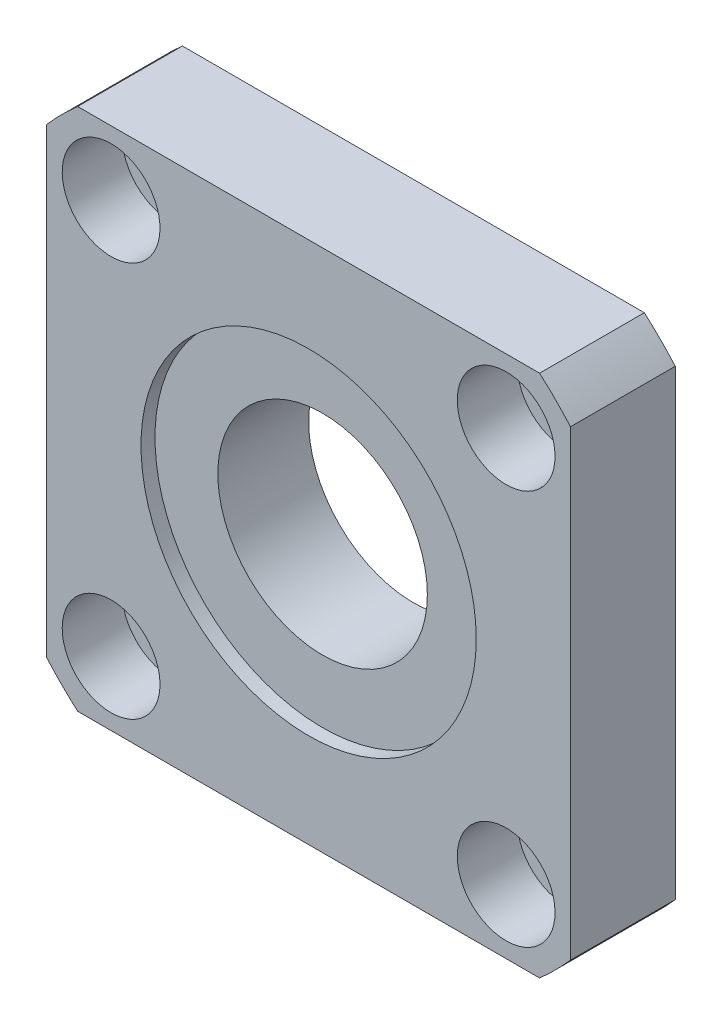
ISO-10303-21;
HEADER;
FILE_DESCRIPTION(('STEP AP214'),'2;1');
FILE_NAME('part.step','',(''),(''),'','','');
FILE_SCHEMA(('AUTOMOTIVE_DESIGN { 1 0 10303 214 1 1 1 1 }'));
ENDSEC;
DATA;
#1=APPLICATION_CONTEXT('core data for automotive mechanical design processes');
#2=APPLICATION_PROTOCOL_DEFINITION('international standard','automotive_design',2000,#1);
#3=PRODUCT_CONTEXT('',#1,'mechanical');
#4=PRODUCT('Part','Part','',(#3));
#5=PRODUCT_RELATED_PRODUCT_CATEGORY('part','',(#4));
#6=PRODUCT_DEFINITION_FORMATION('','',#4);
#7=PRODUCT_DEFINITION_CONTEXT('part definition',#1,'design');
#8=PRODUCT_DEFINITION('design','',#6,#7);
#9=PRODUCT_DEFINITION_SHAPE('','',#8);
#10=(LENGTH_UNIT() NAMED_UNIT(*) SI_UNIT(.MILLI.,.METRE.));
#11=(NAMED_UNIT(*) PLANE_ANGLE_UNIT() SI_UNIT($,.RADIAN.));
#12=(NAMED_UNIT(*) SI_UNIT($,.STERADIAN.) SOLID_ANGLE_UNIT());
#13=UNCERTAINTY_MEASURE_WITH_UNIT(LENGTH_MEASURE(1.E-05),#10,'distance_accuracy_value','');
#14=(GEOMETRIC_REPRESENTATION_CONTEXT(3) GLOBAL_UNCERTAINTY_ASSIGNED_CONTEXT((#13)) GLOBAL_UNIT_ASSIGNED_CONTEXT((#10,
#11,#12)) REPRESENTATION_CONTEXT('',''));
#15=CARTESIAN_POINT('',(0.,0.,0.));
#16=DIRECTION('',(0.,0.,1.));
#17=DIRECTION('',(1.,0.,0.));
#18=AXIS2_PLACEMENT_3D('',#15,#16,#17);
#19=CARTESIAN_POINT('',(0.,0.,15.));
#20=DIRECTION('',(0.,0.,-1.));
#21=DIRECTION('',(-1.,0.,0.));
#22=AXIS2_PLACEMENT_3D('',#19,#20,#21);
#23=CYLINDRICAL_SURFACE('',#22,15.);
#24=CARTESIAN_POINT('',(0.,0.,0.));
#25=DIRECTION('',(0.,0.,1.));
#26=DIRECTION('',(1.,0.,0.));
#27=AXIS2_PLACEMENT_3D('',#24,#25,#26);
#28=CIRCLE('',#27,15.);
#29=CARTESIAN_POINT('',(15.,0.,0.));
#30=VERTEX_POINT('',#29);
#31=EDGE_CURVE('E95',#30,#30,#28,.T.);
#32=ORIENTED_EDGE('',*,*,#31,.F.);
#33=EDGE_LOOP('',(#32));
#34=FACE_BOUND('',#33,.T.);
#35=CARTESIAN_POINT('',(0.,0.,13.));
#36=DIRECTION('',(0.,0.,1.));
#37=DIRECTION('',(1.,0.,0.));
#38=AXIS2_PLACEMENT_3D('',#35,#36,#37);
#39=CIRCLE('',#38,15.);
#40=CARTESIAN_POINT('',(15.,0.,13.));
#41=VERTEX_POINT('',#40);
#42=EDGE_CURVE('E18',#41,#41,#39,.T.);
#43=ORIENTED_EDGE('',*,*,#42,.T.);
#44=EDGE_LOOP('',(#43));
#45=FACE_BOUND('',#44,.T.);
#46=ADVANCED_FACE('F14',(#34,#45),#23,.F.);
#47=CARTESIAN_POINT('',(-28.2842712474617,28.2842712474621,0.));
#48=DIRECTION('',(0.,0.,1.));
#49=DIRECTION('',(1.,0.,0.));
#50=AXIS2_PLACEMENT_3D('',#47,#48,#49);
#51=CYLINDRICAL_SURFACE('',#50,5.);
#52=CARTESIAN_POINT('',(-28.2842712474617,28.2842712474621,0.));
#53=DIRECTION('',(0.,0.,1.));
#54=DIRECTION('',(0.,1.,0.));
#55=AXIS2_PLACEMENT_3D('',#52,#53,#54);
#56=CIRCLE('',#55,5.);
#57=CARTESIAN_POINT('',(-28.2842712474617,33.2842712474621,0.));
#58=VERTEX_POINT('',#57);
#59=EDGE_CURVE('E158',#58,#58,#56,.T.);
#60=ORIENTED_EDGE('',*,*,#59,.F.);
#61=EDGE_LOOP('',(#60));
#62=FACE_BOUND('',#61,.T.);
#63=CARTESIAN_POINT('',(-28.2842712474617,28.2842712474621,6.4));
#64=DIRECTION('',(0.,0.,1.));
#65=DIRECTION('',(1.,0.,0.));
#66=AXIS2_PLACEMENT_3D('',#63,#64,#65);
#67=CIRCLE('',#66,5.);
#68=CARTESIAN_POINT('',(-23.2842712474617,28.2842712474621,6.4));
#69=VERTEX_POINT('',#68);
#70=EDGE_CURVE('E164',#69,#69,#67,.F.);
#71=ORIENTED_EDGE('',*,*,#70,.F.);
#72=EDGE_LOOP('',(#71));
#73=FACE_BOUND('',#72,.T.);
#74=ADVANCED_FACE('F206',(#62,#73),#51,.F.);
#75=CARTESIAN_POINT('',(-28.2842712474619,-28.2842712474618,0.));
#76=DIRECTION('',(0.,0.,1.));
#77=DIRECTION('',(1.,0.,0.));
#78=AXIS2_PLACEMENT_3D('',#75,#76,#77);
#79=CYLINDRICAL_SURFACE('',#78,5.);
#80=CARTESIAN_POINT('',(-28.2842712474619,-28.2842712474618,0.));
#81=DIRECTION('',(0.,0.,1.));
#82=DIRECTION('',(-1.,0.,0.));
#83=AXIS2_PLACEMENT_3D('',#80,#81,#82);
#84=CIRCLE('',#83,5.);
#85=CARTESIAN_POINT('',(-33.284271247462,-28.2842712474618,0.));
#86=VERTEX_POINT('',#85);
#87=EDGE_CURVE('E189',#86,#86,#84,.T.);
#88=ORIENTED_EDGE('',*,*,#87,.F.);
#89=EDGE_LOOP('',(#88));
#90=FACE_BOUND('',#89,.T.);
#91=CARTESIAN_POINT('',(-28.2842712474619,-28.2842712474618,6.4));
#92=DIRECTION('',(0.,0.,1.));
#93=DIRECTION('',(1.,0.,0.));
#94=AXIS2_PLACEMENT_3D('',#91,#92,#93);
#95=CIRCLE('',#94,5.);
#96=CARTESIAN_POINT('',(-23.2842712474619,-28.2842712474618,6.4));
#97=VERTEX_POINT('',#96);
#98=EDGE_CURVE('E160',#97,#97,#95,.F.);
#99=ORIENTED_EDGE('',*,*,#98,.F.);
#100=EDGE_LOOP('',(#99));
#101=FACE_BOUND('',#100,.T.);
#102=ADVANCED_FACE('F288',(#90,#101),#79,.F.);
#103=CARTESIAN_POINT('',(28.2842712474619,-28.2842712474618,0.));
#104=DIRECTION('',(0.,0.,1.));
#105=DIRECTION('',(1.,0.,0.));
#106=AXIS2_PLACEMENT_3D('',#103,#104,#105);
#107=CYLINDRICAL_SURFACE('',#106,5.);
#108=CARTESIAN_POINT('',(28.2842712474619,-28.2842712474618,0.));
#109=DIRECTION('',(0.,0.,1.));
#110=DIRECTION('',(0.,-1.,0.));
#111=AXIS2_PLACEMENT_3D('',#108,#109,#110);
#112=CIRCLE('',#111,5.);
#113=CARTESIAN_POINT('',(28.2842712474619,-33.2842712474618,0.));
#114=VERTEX_POINT('',#113);
#115=EDGE_CURVE('E192',#114,#114,#112,.T.);
#116=ORIENTED_EDGE('',*,*,#115,.F.);
#117=EDGE_LOOP('',(#116));
#118=FACE_BOUND('',#117,.T.);
#119=CARTESIAN_POINT('',(28.2842712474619,-28.2842712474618,6.4));
#120=DIRECTION('',(0.,0.,1.));
#121=DIRECTION('',(1.,0.,0.));
#122=AXIS2_PLACEMENT_3D('',#119,#120,#121);
#123=CIRCLE('',#122,5.);
#124=CARTESIAN_POINT('',(33.284271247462,-28.2842712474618,6.4));
#125=VERTEX_POINT('',#124);
#126=EDGE_CURVE('E155',#125,#125,#123,.F.);
#127=ORIENTED_EDGE('',*,*,#126,.F.);
#128=EDGE_LOOP('',(#127));
#129=FACE_BOUND('',#128,.T.);
#130=ADVANCED_FACE('F276',(#118,#129),#107,.F.);
#131=CARTESIAN_POINT('',(28.2842712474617,28.2842712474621,0.));
#132=DIRECTION('',(0.,0.,1.));
#133=DIRECTION('',(1.,0.,0.));
#134=AXIS2_PLACEMENT_3D('',#131,#132,#133);
#135=CYLINDRICAL_SURFACE('',#134,5.);
#136=CARTESIAN_POINT('',(28.2842712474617,28.2842712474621,0.));
#137=DIRECTION('',(0.,0.,1.));
#138=DIRECTION('',(1.,0.,0.));
#139=AXIS2_PLACEMENT_3D('',#136,#137,#138);
#140=CIRCLE('',#139,5.);
#141=CARTESIAN_POINT('',(33.2842712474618,28.2842712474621,0.));
#142=VERTEX_POINT('',#141);
#143=EDGE_CURVE('E153',#142,#142,#140,.T.);
#144=ORIENTED_EDGE('',*,*,#143,.F.);
#145=EDGE_LOOP('',(#144));
#146=FACE_BOUND('',#145,.T.);
#147=CARTESIAN_POINT('',(28.2842712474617,28.2842712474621,6.4));
#148=DIRECTION('',(0.,0.,1.));
#149=DIRECTION('',(1.,0.,0.));
#150=AXIS2_PLACEMENT_3D('',#147,#148,#149);
#151=CIRCLE('',#150,5.);
#152=CARTESIAN_POINT('',(33.2842712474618,28.2842712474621,6.4));
#153=VERTEX_POINT('',#152);
#154=EDGE_CURVE('E150',#153,#153,#151,.F.);
#155=ORIENTED_EDGE('',*,*,#154,.F.);
#156=EDGE_LOOP('',(#155));
#157=FACE_BOUND('',#156,.T.);
#158=ADVANCED_FACE('F225',(#146,#157),#135,.F.);
#159=CARTESIAN_POINT('',(0.,0.,15.));
#160=DIRECTION('',(0.,0.,1.));
#161=DIRECTION('',(1.,0.,0.));
#162=AXIS2_PLACEMENT_3D('',#159,#160,#161);
#163=PLANE('',#162);
#164=CARTESIAN_POINT('',(0.,0.,15.));
#165=DIRECTION('',(0.,0.,1.));
#166=DIRECTION('',(1.,0.,0.));
#167=AXIS2_PLACEMENT_3D('',#164,#165,#166);
#168=CIRCLE('',#167,24.);
#169=CARTESIAN_POINT('',(24.,0.,15.));
#170=VERTEX_POINT('',#169);
#171=EDGE_CURVE('E213',#170,#170,#168,.T.);
#172=ORIENTED_EDGE('',*,*,#171,.F.);
#173=EDGE_LOOP('',(#172));
#174=FACE_BOUND('',#173,.T.);
#175=CARTESIAN_POINT('',(-28.2842712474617,28.2842712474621,15.));
#176=DIRECTION('',(0.,0.,1.));
#177=DIRECTION('',(0.,1.,0.));
#178=AXIS2_PLACEMENT_3D('',#175,#176,#177);
#179=CIRCLE('',#178,7.);
#180=CARTESIAN_POINT('',(-28.2842712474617,35.2842712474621,15.));
#181=VERTEX_POINT('',#180);
#182=EDGE_CURVE('E173',#181,#181,#179,.T.);
#183=ORIENTED_EDGE('',*,*,#182,.F.);
#184=EDGE_LOOP('',(#183));
#185=FACE_BOUND('',#184,.T.);
#186=CARTESIAN_POINT('',(-28.2842712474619,-28.2842712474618,15.));
#187=DIRECTION('',(0.,0.,1.));
#188=DIRECTION('',(-1.,0.,0.));
#189=AXIS2_PLACEMENT_3D('',#186,#187,#188);
#190=CIRCLE('',#189,7.);
#191=CARTESIAN_POINT('',(-35.284271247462,-28.2842712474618,15.));
#192=VERTEX_POINT('',#191);
#193=EDGE_CURVE('E166',#192,#192,#190,.T.);
#194=ORIENTED_EDGE('',*,*,#193,.F.);
#195=EDGE_LOOP('',(#194));
#196=FACE_BOUND('',#195,.T.);
#197=CARTESIAN_POINT('',(28.2842712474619,-28.2842712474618,15.));
#198=DIRECTION('',(0.,0.,1.));
#199=DIRECTION('',(0.,-1.,0.));
#200=AXIS2_PLACEMENT_3D('',#197,#198,#199);
#201=CIRCLE('',#200,7.);
#202=CARTESIAN_POINT('',(28.2842712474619,-35.2842712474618,15.));
#203=VERTEX_POINT('',#202);
#204=EDGE_CURVE('E162',#203,#203,#201,.T.);
#205=ORIENTED_EDGE('',*,*,#204,.F.);
#206=EDGE_LOOP('',(#205));
#207=FACE_BOUND('',#206,.T.);
#208=CARTESIAN_POINT('',(28.2842712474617,28.2842712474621,15.));
#209=DIRECTION('',(0.,0.,1.));
#210=DIRECTION('',(1.,0.,0.));
#211=AXIS2_PLACEMENT_3D('',#208,#209,#210);
#212=CIRCLE('',#211,7.);
#213=CARTESIAN_POINT('',(35.2842712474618,28.2842712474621,15.));
#214=VERTEX_POINT('',#213);
#215=EDGE_CURVE('E195',#214,#214,#212,.T.);
#216=ORIENTED_EDGE('',*,*,#215,.F.);
#217=EDGE_LOOP('',(#216));
#218=FACE_BOUND('',#217,.T.);
#219=CARTESIAN_POINT('',(0.,0.,15.));
#220=DIRECTION('',(0.,0.,1.));
#221=DIRECTION('',(1.,0.,0.));
#222=AXIS2_PLACEMENT_3D('',#219,#220,#221);
#223=CIRCLE('',#222,50.);
#224=CARTESIAN_POINT('',(37.5,33.0718913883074,15.));
#225=VERTEX_POINT('',#224);
#226=CARTESIAN_POINT('',(33.0718913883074,37.5,15.));
#227=VERTEX_POINT('',#226);
#228=EDGE_CURVE('E120',#225,#227,#223,.T.);
#229=ORIENTED_EDGE('',*,*,#228,.T.);
#230=DIRECTION('',(-1.,0.,0.));
#231=VECTOR('',#230,1.);
#232=CARTESIAN_POINT('',(33.0718913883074,37.5,15.));
#233=LINE('',#232,#231);
#234=CARTESIAN_POINT('',(-33.0718913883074,37.5,15.));
#235=VERTEX_POINT('',#234);
#236=EDGE_CURVE('E87',#227,#235,#233,.T.);
#237=ORIENTED_EDGE('',*,*,#236,.T.);
#238=CARTESIAN_POINT('',(0.,0.,15.));
#239=DIRECTION('',(0.,0.,-1.));
#240=DIRECTION('',(-1.,0.,0.));
#241=AXIS2_PLACEMENT_3D('',#238,#239,#240);
#242=CIRCLE('',#241,50.);
#243=CARTESIAN_POINT('',(-37.5,33.0718913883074,15.));
#244=VERTEX_POINT('',#243);
#245=EDGE_CURVE('E123',#244,#235,#242,.T.);
#246=ORIENTED_EDGE('',*,*,#245,.F.);
#247=DIRECTION('',(0.,-1.,0.));
#248=VECTOR('',#247,1.);
#249=CARTESIAN_POINT('',(-37.5,33.0718913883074,15.));
#250=LINE('',#249,#248);
#251=CARTESIAN_POINT('',(-37.5,-33.0718913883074,15.));
#252=VERTEX_POINT('',#251);
#253=EDGE_CURVE('E126',#244,#252,#250,.T.);
#254=ORIENTED_EDGE('',*,*,#253,.T.);
#255=CARTESIAN_POINT('',(0.,0.,15.));
#256=DIRECTION('',(0.,0.,1.));
#257=DIRECTION('',(1.,0.,0.));
#258=AXIS2_PLACEMENT_3D('',#255,#256,#257);
#259=CIRCLE('',#258,50.);
#260=CARTESIAN_POINT('',(-33.0718913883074,-37.5,15.));
#261=VERTEX_POINT('',#260);
#262=EDGE_CURVE('E129',#252,#261,#259,.T.);
#263=ORIENTED_EDGE('',*,*,#262,.T.);
#264=DIRECTION('',(-1.,0.,0.));
#265=VECTOR('',#264,1.);
#266=CARTESIAN_POINT('',(33.0718913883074,-37.5,15.));
#267=LINE('',#266,#265);
#268=CARTESIAN_POINT('',(33.0718913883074,-37.5,15.));
#269=VERTEX_POINT('',#268);
#270=EDGE_CURVE('E132',#269,#261,#267,.T.);
#271=ORIENTED_EDGE('',*,*,#270,.F.);
#272=CARTESIAN_POINT('',(0.,0.,15.));
#273=DIRECTION('',(0.,0.,-1.));
#274=DIRECTION('',(-1.,0.,0.));
#275=AXIS2_PLACEMENT_3D('',#272,#273,#274);
#276=CIRCLE('',#275,50.);
#277=CARTESIAN_POINT('',(37.5,-33.0718913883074,15.));
#278=VERTEX_POINT('',#277);
#279=EDGE_CURVE('E135',#278,#269,#276,.T.);
#280=ORIENTED_EDGE('',*,*,#279,.F.);
#281=DIRECTION('',(0.,-1.,0.));
#282=VECTOR('',#281,1.);
#283=CARTESIAN_POINT('',(37.5,33.0718913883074,15.));
#284=LINE('',#283,#282);
#285=EDGE_CURVE('E137',#225,#278,#284,.T.);
#286=ORIENTED_EDGE('',*,*,#285,.F.);
#287=EDGE_LOOP('',(#229,#237,#246,#254,#263,#271,#280,#286));
#288=FACE_BOUND('',#287,.T.);
#289=ADVANCED_FACE('F222',(#174,#185,#196,#207,#218,#288),#163,.T.);
#290=CARTESIAN_POINT('',(0.,0.,0.));
#291=DIRECTION('',(0.,0.,1.));
#292=DIRECTION('',(1.,0.,0.));
#293=AXIS2_PLACEMENT_3D('',#290,#291,#292);
#294=PLANE('',#293);
#295=ORIENTED_EDGE('',*,*,#59,.T.);
#296=EDGE_LOOP('',(#295));
#297=FACE_BOUND('',#296,.T.);
#298=ORIENTED_EDGE('',*,*,#87,.T.);
#299=EDGE_LOOP('',(#298));
#300=FACE_BOUND('',#299,.T.);
#301=ORIENTED_EDGE('',*,*,#115,.T.);
#302=EDGE_LOOP('',(#301));
#303=FACE_BOUND('',#302,.T.);
#304=ORIENTED_EDGE('',*,*,#143,.T.);
#305=EDGE_LOOP('',(#304));
#306=FACE_BOUND('',#305,.T.);
#307=CARTESIAN_POINT('',(0.,0.,0.));
#308=DIRECTION('',(0.,0.,1.));
#309=DIRECTION('',(1.,0.,0.));
#310=AXIS2_PLACEMENT_3D('',#307,#308,#309);
#311=CIRCLE('',#310,50.);
#312=CARTESIAN_POINT('',(37.5,33.0718913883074,0.));
#313=VERTEX_POINT('',#312);
#314=CARTESIAN_POINT('',(33.0718913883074,37.5,0.));
#315=VERTEX_POINT('',#314);
#316=EDGE_CURVE('E91',#313,#315,#311,.T.);
#317=ORIENTED_EDGE('',*,*,#316,.F.);
#318=DIRECTION('',(0.,-1.,0.));
#319=VECTOR('',#318,1.);
#320=CARTESIAN_POINT('',(37.5,33.0718913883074,0.));
#321=LINE('',#320,#319);
#322=CARTESIAN_POINT('',(37.5,-33.0718913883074,0.));
#323=VERTEX_POINT('',#322);
#324=EDGE_CURVE('E118',#313,#323,#321,.T.);
#325=ORIENTED_EDGE('',*,*,#324,.T.);
#326=CARTESIAN_POINT('',(0.,0.,0.));
#327=DIRECTION('',(0.,0.,-1.));
#328=DIRECTION('',(-1.,0.,0.));
#329=AXIS2_PLACEMENT_3D('',#326,#327,#328);
#330=CIRCLE('',#329,50.);
#331=CARTESIAN_POINT('',(33.0718913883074,-37.5,0.));
#332=VERTEX_POINT('',#331);
#333=EDGE_CURVE('E115',#323,#332,#330,.T.);
#334=ORIENTED_EDGE('',*,*,#333,.T.);
#335=DIRECTION('',(-1.,0.,0.));
#336=VECTOR('',#335,1.);
#337=CARTESIAN_POINT('',(33.0718913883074,-37.5,0.));
#338=LINE('',#337,#336);
#339=CARTESIAN_POINT('',(-33.0718913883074,-37.5,0.));
#340=VERTEX_POINT('',#339);
#341=EDGE_CURVE('E112',#332,#340,#338,.T.);
#342=ORIENTED_EDGE('',*,*,#341,.T.);
#343=CARTESIAN_POINT('',(0.,0.,0.));
#344=DIRECTION('',(0.,0.,1.));
#345=DIRECTION('',(1.,0.,0.));
#346=AXIS2_PLACEMENT_3D('',#343,#344,#345);
#347=CIRCLE('',#346,50.);
#348=CARTESIAN_POINT('',(-37.5,-33.0718913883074,0.));
#349=VERTEX_POINT('',#348);
#350=EDGE_CURVE('E109',#349,#340,#347,.T.);
#351=ORIENTED_EDGE('',*,*,#350,.F.);
#352=DIRECTION('',(0.,-1.,0.));
#353=VECTOR('',#352,1.);
#354=CARTESIAN_POINT('',(-37.5,33.0718913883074,0.));
#355=LINE('',#354,#353);
#356=CARTESIAN_POINT('',(-37.5,33.0718913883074,0.));
#357=VERTEX_POINT('',#356);
#358=EDGE_CURVE('E103',#357,#349,#355,.T.);
#359=ORIENTED_EDGE('',*,*,#358,.F.);
#360=CARTESIAN_POINT('',(0.,0.,0.));
#361=DIRECTION('',(0.,0.,-1.));
#362=DIRECTION('',(-1.,0.,0.));
#363=AXIS2_PLACEMENT_3D('',#360,#361,#362);
#364=CIRCLE('',#363,50.);
#365=CARTESIAN_POINT('',(-33.0718913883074,37.5,0.));
#366=VERTEX_POINT('',#365);
#367=EDGE_CURVE('E101',#357,#366,#364,.T.);
#368=ORIENTED_EDGE('',*,*,#367,.T.);
#369=DIRECTION('',(-1.,0.,0.));
#370=VECTOR('',#369,1.);
#371=CARTESIAN_POINT('',(33.0718913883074,37.5,0.));
#372=LINE('',#371,#370);
#373=EDGE_CURVE('E84',#315,#366,#372,.T.);
#374=ORIENTED_EDGE('',*,*,#373,.F.);
#375=EDGE_LOOP('',(#317,#325,#334,#342,#351,#359,#368,#374));
#376=FACE_BOUND('',#375,.T.);
#377=ORIENTED_EDGE('',*,*,#31,.T.);
#378=EDGE_LOOP('',(#377));
#379=FACE_BOUND('',#378,.T.);
#380=ADVANCED_FACE('F97',(#297,#300,#303,#306,#376,#379),#294,.F.);
#381=CARTESIAN_POINT('',(0.,0.,15.));
#382=DIRECTION('',(0.,0.,-1.));
#383=DIRECTION('',(-1.,0.,0.));
#384=AXIS2_PLACEMENT_3D('',#381,#382,#383);
#385=CYLINDRICAL_SURFACE('',#384,50.);
#386=DIRECTION('',(0.,0.,-1.));
#387=VECTOR('',#386,1.);
#388=CARTESIAN_POINT('',(33.0718913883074,37.5,15.));
#389=LINE('',#388,#387);
#390=EDGE_CURVE('E9',#227,#315,#389,.T.);
#391=ORIENTED_EDGE('',*,*,#390,.F.);
#392=ORIENTED_EDGE('',*,*,#228,.F.);
#393=DIRECTION('',(0.,0.,-1.));
#394=VECTOR('',#393,1.);
#395=CARTESIAN_POINT('',(37.5,33.0718913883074,15.));
#396=LINE('',#395,#394);
#397=EDGE_CURVE('E31',#225,#313,#396,.T.);
#398=ORIENTED_EDGE('',*,*,#397,.T.);
#399=ORIENTED_EDGE('',*,*,#316,.T.);
#400=EDGE_LOOP('',(#391,#392,#398,#399));
#401=FACE_BOUND('',#400,.T.);
#402=ADVANCED_FACE('F92',(#401),#385,.T.);
#403=CARTESIAN_POINT('',(33.0718913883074,37.5,15.));
#404=DIRECTION('',(0.,-1.,0.));
#405=DIRECTION('',(0.,0.,-1.));
#406=AXIS2_PLACEMENT_3D('',#403,#404,#405);
#407=PLANE('',#406);
#408=DIRECTION('',(0.,0.,-1.));
#409=VECTOR('',#408,1.);
#410=CARTESIAN_POINT('',(-33.0718913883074,37.5,15.));
#411=LINE('',#410,#409);
#412=EDGE_CURVE('E23',#235,#366,#411,.T.);
#413=ORIENTED_EDGE('',*,*,#412,.F.);
#414=ORIENTED_EDGE('',*,*,#236,.F.);
#415=ORIENTED_EDGE('',*,*,#390,.T.);
#416=ORIENTED_EDGE('',*,*,#373,.T.);
#417=EDGE_LOOP('',(#413,#414,#415,#416));
#418=FACE_BOUND('',#417,.T.);
#419=ADVANCED_FACE('F16',(#418),#407,.F.);
#420=CARTESIAN_POINT('',(0.,0.,15.));
#421=DIRECTION('',(0.,0.,-1.));
#422=DIRECTION('',(-1.,0.,0.));
#423=AXIS2_PLACEMENT_3D('',#420,#421,#422);
#424=CYLINDRICAL_SURFACE('',#423,50.);
#425=DIRECTION('',(0.,0.,-1.));
#426=VECTOR('',#425,1.);
#427=CARTESIAN_POINT('',(-37.5,33.0718913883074,15.));
#428=LINE('',#427,#426);
#429=EDGE_CURVE('E147',#244,#357,#428,.T.);
#430=ORIENTED_EDGE('',*,*,#429,.F.);
#431=ORIENTED_EDGE('',*,*,#245,.T.);
#432=ORIENTED_EDGE('',*,*,#412,.T.);
#433=ORIENTED_EDGE('',*,*,#367,.F.);
#434=EDGE_LOOP('',(#430,#431,#432,#433));
#435=FACE_BOUND('',#434,.T.);
#436=ADVANCED_FACE('F251',(#435),#424,.T.);
#437=CARTESIAN_POINT('',(-37.5,33.0718913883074,15.));
#438=DIRECTION('',(1.,0.,0.));
#439=DIRECTION('',(0.,0.,-1.));
#440=AXIS2_PLACEMENT_3D('',#437,#438,#439);
#441=PLANE('',#440);
#442=DIRECTION('',(0.,0.,-1.));
#443=VECTOR('',#442,1.);
#444=CARTESIAN_POINT('',(-37.5,-33.0718913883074,15.));
#445=LINE('',#444,#443);
#446=EDGE_CURVE('E145',#252,#349,#445,.T.);
#447=ORIENTED_EDGE('',*,*,#446,.F.);
#448=ORIENTED_EDGE('',*,*,#253,.F.);
#449=ORIENTED_EDGE('',*,*,#429,.T.);
#450=ORIENTED_EDGE('',*,*,#358,.T.);
#451=EDGE_LOOP('',(#447,#448,#449,#450));
#452=FACE_BOUND('',#451,.T.);
#453=ADVANCED_FACE('F249',(#452),#441,.F.);
#454=CARTESIAN_POINT('',(0.,0.,15.));
#455=DIRECTION('',(0.,0.,-1.));
#456=DIRECTION('',(-1.,0.,0.));
#457=AXIS2_PLACEMENT_3D('',#454,#455,#456);
#458=CYLINDRICAL_SURFACE('',#457,50.);
#459=DIRECTION('',(0.,0.,-1.));
#460=VECTOR('',#459,1.);
#461=CARTESIAN_POINT('',(-33.0718913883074,-37.5,15.));
#462=LINE('',#461,#460);
#463=EDGE_CURVE('E143',#261,#340,#462,.T.);
#464=ORIENTED_EDGE('',*,*,#463,.F.);
#465=ORIENTED_EDGE('',*,*,#262,.F.);
#466=ORIENTED_EDGE('',*,*,#446,.T.);
#467=ORIENTED_EDGE('',*,*,#350,.T.);
#468=EDGE_LOOP('',(#464,#465,#466,#467));
#469=FACE_BOUND('',#468,.T.);
#470=ADVANCED_FACE('F246',(#469),#458,.T.);
#471=CARTESIAN_POINT('',(33.0718913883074,-37.5,15.));
#472=DIRECTION('',(0.,-1.,0.));
#473=DIRECTION('',(0.,0.,-1.));
#474=AXIS2_PLACEMENT_3D('',#471,#472,#473);
#475=PLANE('',#474);
#476=DIRECTION('',(0.,0.,-1.));
#477=VECTOR('',#476,1.);
#478=CARTESIAN_POINT('',(33.0718913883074,-37.5,15.));
#479=LINE('',#478,#477);
#480=EDGE_CURVE('E141',#269,#332,#479,.T.);
#481=ORIENTED_EDGE('',*,*,#480,.F.);
#482=ORIENTED_EDGE('',*,*,#270,.T.);
#483=ORIENTED_EDGE('',*,*,#463,.T.);
#484=ORIENTED_EDGE('',*,*,#341,.F.);
#485=EDGE_LOOP('',(#481,#482,#483,#484));
#486=FACE_BOUND('',#485,.T.);
#487=ADVANCED_FACE('F243',(#486),#475,.T.);
#488=CARTESIAN_POINT('',(0.,0.,15.));
#489=DIRECTION('',(0.,0.,-1.));
#490=DIRECTION('',(-1.,0.,0.));
#491=AXIS2_PLACEMENT_3D('',#488,#489,#490);
#492=CYLINDRICAL_SURFACE('',#491,50.);
#493=DIRECTION('',(0.,0.,-1.));
#494=VECTOR('',#493,1.);
#495=CARTESIAN_POINT('',(37.5,-33.0718913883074,15.));
#496=LINE('',#495,#494);
#497=EDGE_CURVE('E39',#278,#323,#496,.T.);
#498=ORIENTED_EDGE('',*,*,#497,.F.);
#499=ORIENTED_EDGE('',*,*,#279,.T.);
#500=ORIENTED_EDGE('',*,*,#480,.T.);
#501=ORIENTED_EDGE('',*,*,#333,.F.);
#502=EDGE_LOOP('',(#498,#499,#500,#501));
#503=FACE_BOUND('',#502,.T.);
#504=ADVANCED_FACE('F239',(#503),#492,.T.);
#505=CARTESIAN_POINT('',(37.5,33.0718913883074,15.));
#506=DIRECTION('',(1.,0.,0.));
#507=DIRECTION('',(0.,0.,-1.));
#508=AXIS2_PLACEMENT_3D('',#505,#506,#507);
#509=PLANE('',#508);
#510=ORIENTED_EDGE('',*,*,#285,.T.);
#511=ORIENTED_EDGE('',*,*,#497,.T.);
#512=ORIENTED_EDGE('',*,*,#324,.F.);
#513=ORIENTED_EDGE('',*,*,#397,.F.);
#514=EDGE_LOOP('',(#510,#511,#512,#513));
#515=FACE_BOUND('',#514,.T.);
#516=ADVANCED_FACE('F238',(#515),#509,.T.);
#517=CARTESIAN_POINT('',(28.2842712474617,28.2842712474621,6.4));
#518=DIRECTION('',(0.,0.,1.));
#519=DIRECTION('',(1.,0.,0.));
#520=AXIS2_PLACEMENT_3D('',#517,#518,#519);
#521=PLANE('',#520);
#522=CARTESIAN_POINT('',(28.2842712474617,28.2842712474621,6.4));
#523=DIRECTION('',(0.,0.,1.));
#524=DIRECTION('',(1.,0.,0.));
#525=AXIS2_PLACEMENT_3D('',#522,#523,#524);
#526=CIRCLE('',#525,7.);
#527=CARTESIAN_POINT('',(35.2842712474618,28.2842712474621,6.4));
#528=VERTEX_POINT('',#527);
#529=EDGE_CURVE('E154',#528,#528,#526,.T.);
#530=ORIENTED_EDGE('',*,*,#529,.T.);
#531=EDGE_LOOP('',(#530));
#532=FACE_BOUND('',#531,.T.);
#533=ORIENTED_EDGE('',*,*,#154,.T.);
#534=EDGE_LOOP('',(#533));
#535=FACE_BOUND('',#534,.T.);
#536=ADVANCED_FACE('F268',(#532,#535),#521,.T.);
#537=CARTESIAN_POINT('',(28.2842712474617,28.2842712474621,6.4));
#538=DIRECTION('',(0.,0.,1.));
#539=DIRECTION('',(1.,0.,0.));
#540=AXIS2_PLACEMENT_3D('',#537,#538,#539);
#541=CYLINDRICAL_SURFACE('',#540,7.);
#542=ORIENTED_EDGE('',*,*,#529,.F.);
#543=EDGE_LOOP('',(#542));
#544=FACE_BOUND('',#543,.T.);
#545=ORIENTED_EDGE('',*,*,#215,.T.);
#546=EDGE_LOOP('',(#545));
#547=FACE_BOUND('',#546,.T.);
#548=ADVANCED_FACE('F278',(#544,#547),#541,.F.);
#549=CARTESIAN_POINT('',(28.2842712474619,-28.2842712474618,6.4));
#550=DIRECTION('',(0.,0.,1.));
#551=DIRECTION('',(0.,-1.,0.));
#552=AXIS2_PLACEMENT_3D('',#549,#550,#551);
#553=PLANE('',#552);
#554=CARTESIAN_POINT('',(28.2842712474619,-28.2842712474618,6.4));
#555=DIRECTION('',(0.,0.,1.));
#556=DIRECTION('',(0.,-1.,0.));
#557=AXIS2_PLACEMENT_3D('',#554,#555,#556);
#558=CIRCLE('',#557,7.);
#559=CARTESIAN_POINT('',(28.2842712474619,-35.2842712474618,6.4));
#560=VERTEX_POINT('',#559);
#561=EDGE_CURVE('E159',#560,#560,#558,.T.);
#562=ORIENTED_EDGE('',*,*,#561,.T.);
#563=EDGE_LOOP('',(#562));
#564=FACE_BOUND('',#563,.T.);
#565=ORIENTED_EDGE('',*,*,#126,.T.);
#566=EDGE_LOOP('',(#565));
#567=FACE_BOUND('',#566,.T.);
#568=ADVANCED_FACE('F281',(#564,#567),#553,.T.);
#569=CARTESIAN_POINT('',(28.2842712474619,-28.2842712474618,6.4));
#570=DIRECTION('',(0.,0.,1.));
#571=DIRECTION('',(1.,0.,0.));
#572=AXIS2_PLACEMENT_3D('',#569,#570,#571);
#573=CYLINDRICAL_SURFACE('',#572,7.);
#574=ORIENTED_EDGE('',*,*,#561,.F.);
#575=EDGE_LOOP('',(#574));
#576=FACE_BOUND('',#575,.T.);
#577=ORIENTED_EDGE('',*,*,#204,.T.);
#578=EDGE_LOOP('',(#577));
#579=FACE_BOUND('',#578,.T.);
#580=ADVANCED_FACE('F296',(#576,#579),#573,.F.);
#581=CARTESIAN_POINT('',(-28.2842712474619,-28.2842712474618,6.4));
#582=DIRECTION('',(0.,0.,1.));
#583=DIRECTION('',(-1.,0.,0.));
#584=AXIS2_PLACEMENT_3D('',#581,#582,#583);
#585=PLANE('',#584);
#586=CARTESIAN_POINT('',(-28.2842712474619,-28.2842712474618,6.4));
#587=DIRECTION('',(0.,0.,1.));
#588=DIRECTION('',(-1.,0.,0.));
#589=AXIS2_PLACEMENT_3D('',#586,#587,#588);
#590=CIRCLE('',#589,7.);
#591=CARTESIAN_POINT('',(-35.284271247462,-28.2842712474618,6.4));
#592=VERTEX_POINT('',#591);
#593=EDGE_CURVE('E163',#592,#592,#590,.T.);
#594=ORIENTED_EDGE('',*,*,#593,.T.);
#595=EDGE_LOOP('',(#594));
#596=FACE_BOUND('',#595,.T.);
#597=ORIENTED_EDGE('',*,*,#98,.T.);
#598=EDGE_LOOP('',(#597));
#599=FACE_BOUND('',#598,.T.);
#600=ADVANCED_FACE('F299',(#596,#599),#585,.T.);
#601=CARTESIAN_POINT('',(-28.2842712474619,-28.2842712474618,6.4));
#602=DIRECTION('',(0.,0.,1.));
#603=DIRECTION('',(1.,0.,0.));
#604=AXIS2_PLACEMENT_3D('',#601,#602,#603);
#605=CYLINDRICAL_SURFACE('',#604,7.);
#606=ORIENTED_EDGE('',*,*,#593,.F.);
#607=EDGE_LOOP('',(#606));
#608=FACE_BOUND('',#607,.T.);
#609=ORIENTED_EDGE('',*,*,#193,.T.);
#610=EDGE_LOOP('',(#609));
#611=FACE_BOUND('',#610,.T.);
#612=ADVANCED_FACE('F304',(#608,#611),#605,.F.);
#613=CARTESIAN_POINT('',(-28.2842712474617,28.2842712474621,6.4));
#614=DIRECTION('',(0.,0.,1.));
#615=DIRECTION('',(0.,1.,0.));
#616=AXIS2_PLACEMENT_3D('',#613,#614,#615);
#617=PLANE('',#616);
#618=CARTESIAN_POINT('',(-28.2842712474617,28.2842712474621,6.4));
#619=DIRECTION('',(0.,0.,1.));
#620=DIRECTION('',(0.,1.,0.));
#621=AXIS2_PLACEMENT_3D('',#618,#619,#620);
#622=CIRCLE('',#621,7.);
#623=CARTESIAN_POINT('',(-28.2842712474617,35.2842712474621,6.4));
#624=VERTEX_POINT('',#623);
#625=EDGE_CURVE('E167',#624,#624,#622,.T.);
#626=ORIENTED_EDGE('',*,*,#625,.T.);
#627=EDGE_LOOP('',(#626));
#628=FACE_BOUND('',#627,.T.);
#629=ORIENTED_EDGE('',*,*,#70,.T.);
#630=EDGE_LOOP('',(#629));
#631=FACE_BOUND('',#630,.T.);
#632=ADVANCED_FACE('F307',(#628,#631),#617,.T.);
#633=CARTESIAN_POINT('',(-28.2842712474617,28.2842712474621,6.4));
#634=DIRECTION('',(0.,0.,1.));
#635=DIRECTION('',(1.,0.,0.));
#636=AXIS2_PLACEMENT_3D('',#633,#634,#635);
#637=CYLINDRICAL_SURFACE('',#636,7.);
#638=ORIENTED_EDGE('',*,*,#625,.F.);
#639=EDGE_LOOP('',(#638));
#640=FACE_BOUND('',#639,.T.);
#641=ORIENTED_EDGE('',*,*,#182,.T.);
#642=EDGE_LOOP('',(#641));
#643=FACE_BOUND('',#642,.T.);
#644=ADVANCED_FACE('F312',(#640,#643),#637,.F.);
#645=CARTESIAN_POINT('',(0.,0.,13.));
#646=DIRECTION('',(0.,0.,1.));
#647=DIRECTION('',(1.,0.,0.));
#648=AXIS2_PLACEMENT_3D('',#645,#646,#647);
#649=CYLINDRICAL_SURFACE('',#648,24.);
#650=CARTESIAN_POINT('',(0.,0.,13.));
#651=DIRECTION('',(0.,0.,1.));
#652=DIRECTION('',(1.,0.,0.));
#653=AXIS2_PLACEMENT_3D('',#650,#651,#652);
#654=CIRCLE('',#653,24.);
#655=CARTESIAN_POINT('',(24.,0.,13.));
#656=VERTEX_POINT('',#655);
#657=EDGE_CURVE('E211',#656,#656,#654,.T.);
#658=ORIENTED_EDGE('',*,*,#657,.F.);
#659=EDGE_LOOP('',(#658));
#660=FACE_BOUND('',#659,.T.);
#661=ORIENTED_EDGE('',*,*,#171,.T.);
#662=EDGE_LOOP('',(#661));
#663=FACE_BOUND('',#662,.T.);
#664=ADVANCED_FACE('F220',(#660,#663),#649,.F.);
#665=CARTESIAN_POINT('',(0.,0.,13.));
#666=DIRECTION('',(0.,0.,1.));
#667=DIRECTION('',(1.,0.,0.));
#668=AXIS2_PLACEMENT_3D('',#665,#666,#667);
#669=PLANE('',#668);
#670=ORIENTED_EDGE('',*,*,#42,.F.);
#671=EDGE_LOOP('',(#670));
#672=FACE_BOUND('',#671,.T.);
#673=ORIENTED_EDGE('',*,*,#657,.T.);
#674=EDGE_LOOP('',(#673));
#675=FACE_BOUND('',#674,.T.);
#676=ADVANCED_FACE('F316',(#672,#675),#669,.T.);
#677=CLOSED_SHELL('',(#46,#74,#102,#130,#158,#289,#380,#402,#419,#436,#453,#470,#487,#504,#516,
#536,#548,#568,#580,#600,#612,#632,#644,#664,#676));
#678=MANIFOLD_SOLID_BREP('B1',#677);
#679=ADVANCED_BREP_SHAPE_REPRESENTATION('',(#18,#678),#14);
#680=SHAPE_DEFINITION_REPRESENTATION(#9,#679);
ENDSEC;
END-ISO-10303-21;
